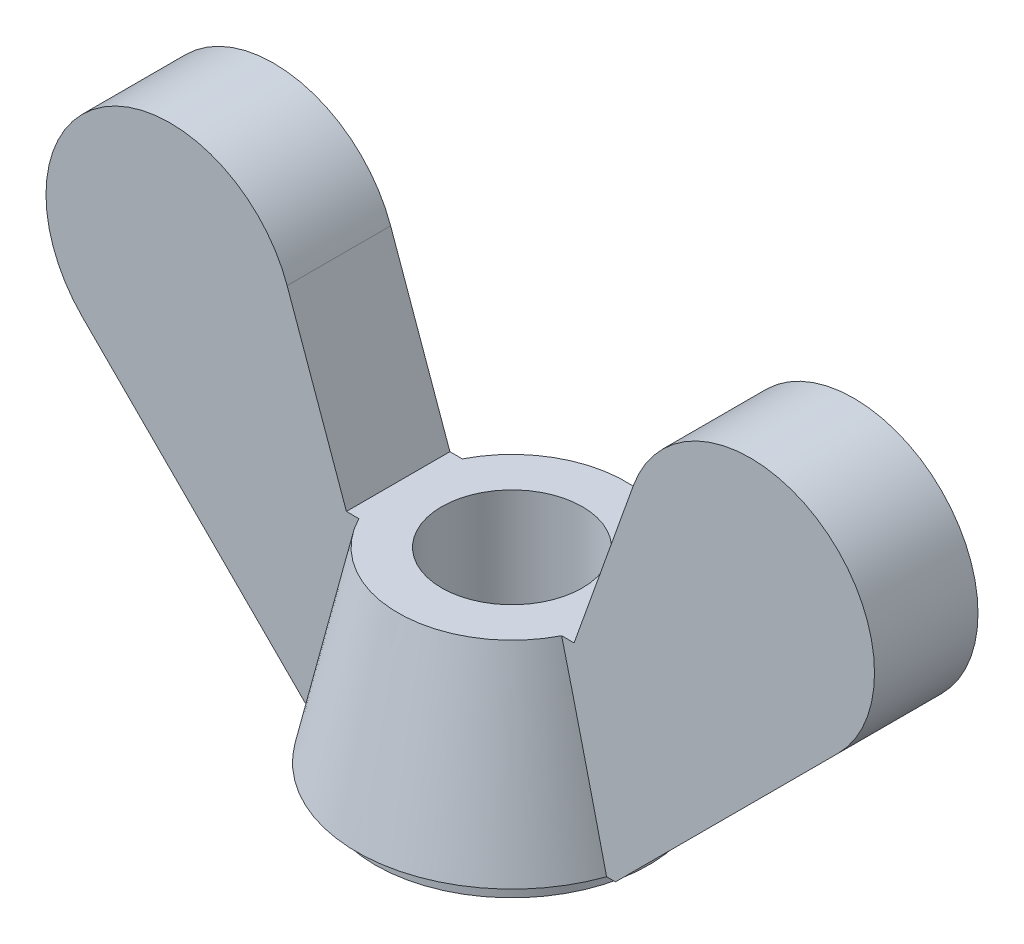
ISO-10303-21;
HEADER;
FILE_DESCRIPTION(('STEP AP214'),'2;1');
FILE_NAME('part.step','',(''),(''),'','','');
FILE_SCHEMA(('AUTOMOTIVE_DESIGN { 1 0 10303 214 1 1 1 1 }'));
ENDSEC;
DATA;
#1=APPLICATION_CONTEXT('core data for automotive mechanical design processes');
#2=APPLICATION_PROTOCOL_DEFINITION('international standard','automotive_design',2000,#1);
#3=PRODUCT_CONTEXT('',#1,'mechanical');
#4=PRODUCT('Part','Part','',(#3));
#5=PRODUCT_RELATED_PRODUCT_CATEGORY('part','',(#4));
#6=PRODUCT_DEFINITION_FORMATION('','',#4);
#7=PRODUCT_DEFINITION_CONTEXT('part definition',#1,'design');
#8=PRODUCT_DEFINITION('design','',#6,#7);
#9=PRODUCT_DEFINITION_SHAPE('','',#8);
#10=(LENGTH_UNIT() NAMED_UNIT(*) SI_UNIT(.MILLI.,.METRE.));
#11=(NAMED_UNIT(*) PLANE_ANGLE_UNIT() SI_UNIT($,.RADIAN.));
#12=(NAMED_UNIT(*) SI_UNIT($,.STERADIAN.) SOLID_ANGLE_UNIT());
#13=UNCERTAINTY_MEASURE_WITH_UNIT(LENGTH_MEASURE(1.E-05),#10,'distance_accuracy_value','');
#14=(GEOMETRIC_REPRESENTATION_CONTEXT(3) GLOBAL_UNCERTAINTY_ASSIGNED_CONTEXT((#13)) GLOBAL_UNIT_ASSIGNED_CONTEXT((#10,
#11,#12)) REPRESENTATION_CONTEXT('',''));
#15=CARTESIAN_POINT('',(0.,0.,0.));
#16=DIRECTION('',(0.,0.,1.));
#17=DIRECTION('',(1.,0.,0.));
#18=AXIS2_PLACEMENT_3D('',#15,#16,#17);
#19=CARTESIAN_POINT('',(-6.6,0.,-2.5));
#20=DIRECTION('',(0.,0.,-1.));
#21=DIRECTION('',(-1.,0.,0.));
#22=AXIS2_PLACEMENT_3D('',#19,#20,#21);
#23=PLANE('',#22);
#24=DIRECTION('',(-1.,0.,0.));
#25=VECTOR('',#24,1.);
#26=CARTESIAN_POINT('',(-6.6,10.,-2.5));
#27=LINE('',#26,#25);
#28=CARTESIAN_POINT('',(-12.1000000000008,9.99999999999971,-2.49999999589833));
#29=VERTEX_POINT('',#28);
#30=CARTESIAN_POINT('',(-11.4989794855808,10.,-2.5));
#31=VERTEX_POINT('',#30);
#32=EDGE_CURVE('E171',#29,#31,#27,.F.);
#33=ORIENTED_EDGE('',*,*,#32,.T.);
#34=CARTESIAN_POINT('',(-13.6710676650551,1.00000062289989,-2.5));
#35=CARTESIAN_POINT('',(-13.49403913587,1.75095649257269,-2.5));
#36=CARTESIAN_POINT('',(-13.3163587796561,2.5017597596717,-2.5));
#37=CARTESIAN_POINT('',(-12.959221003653,4.00293541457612,-2.5));
#38=CARTESIAN_POINT('',(-12.7797636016,4.75330780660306,-2.5));
#39=CARTESIAN_POINT('',(-12.418594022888,6.25351429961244,-2.5));
#40=CARTESIAN_POINT('',(-12.2368818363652,7.00334839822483,-2.5));
#41=CARTESIAN_POINT('',(-11.9620598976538,8.12755262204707,-2.5));
#42=CARTESIAN_POINT('',(-11.8700765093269,8.50219808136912,-2.5));
#43=CARTESIAN_POINT('',(-11.6852249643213,9.25127122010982,-2.5));
#44=CARTESIAN_POINT('',(-11.5923568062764,9.62569889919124,-2.5));
#45=CARTESIAN_POINT('',(-11.4989794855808,10.,-2.5));
#46=B_SPLINE_CURVE_WITH_KNOTS('',3,(#34,#35,#36,#37,#38,#39,#40,#41,#42,#43,#44,#45),
.UNSPECIFIED.,.F.,.F.,(4,2,2,2,2,4),(0.,2.31462088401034,4.62921868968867,6.94382662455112,
8.1011421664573,9.25845949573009),.UNSPECIFIED.);
#47=CARTESIAN_POINT('',(-13.6710676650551,1.00000062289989,-2.5));
#48=VERTEX_POINT('',#47);
#49=EDGE_CURVE('E215',#48,#31,#46,.T.);
#50=ORIENTED_EDGE('',*,*,#49,.F.);
#51=DIRECTION('',(-1.,0.,0.));
#52=VECTOR('',#51,1.);
#53=CARTESIAN_POINT('',(-6.6,1.00000009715,-2.5));
#54=LINE('',#53,#52);
#55=CARTESIAN_POINT('',(-14.1000000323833,1.00000003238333,-2.500000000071));
#56=VERTEX_POINT('',#55);
#57=EDGE_CURVE('E378',#48,#56,#54,.T.);
#58=ORIENTED_EDGE('',*,*,#57,.T.);
#59=DIRECTION('',(0.707106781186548,-0.707106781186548,0.));
#60=VECTOR('',#59,1.);
#61=CARTESIAN_POINT('',(-14.1,1.,-2.5));
#62=LINE('',#61,#60);
#63=CARTESIAN_POINT('',(-24.85735931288,11.75735931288,-2.5));
#64=VERTEX_POINT('',#63);
#65=EDGE_CURVE('E214',#64,#56,#62,.T.);
#66=ORIENTED_EDGE('',*,*,#65,.F.);
#67=CARTESIAN_POINT('',(-20.61471862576,16.,-2.5));
#68=DIRECTION('',(0.,0.,-1.));
#69=DIRECTION('',(-1.,0.,0.));
#70=AXIS2_PLACEMENT_3D('',#67,#68,#69);
#71=CIRCLE('',#70,6.);
#72=CARTESIAN_POINT('',(-14.9644209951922,18.0184490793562,-2.5));
#73=VERTEX_POINT('',#72);
#74=EDGE_CURVE('E338',#73,#64,#71,.F.);
#75=ORIENTED_EDGE('',*,*,#74,.F.);
#76=DIRECTION('',(-0.336408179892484,0.941716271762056,0.));
#77=VECTOR('',#76,1.);
#78=CARTESIAN_POINT('',(-14.96442099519,18.01844907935,-2.5));
#79=LINE('',#78,#77);
#80=EDGE_CURVE('E340',#29,#73,#79,.T.);
#81=ORIENTED_EDGE('',*,*,#80,.F.);
#82=EDGE_LOOP('',(#33,#50,#58,#66,#75,#81));
#83=FACE_BOUND('',#82,.T.);
#84=ADVANCED_FACE('F42',(#83),#23,.T.);
#85=CARTESIAN_POINT('',(-20.61471862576,16.,2.5));
#86=DIRECTION('',(0.,0.,-1.));
#87=DIRECTION('',(-1.,0.,0.));
#88=AXIS2_PLACEMENT_3D('',#85,#86,#87);
#89=CYLINDRICAL_SURFACE('',#88,6.);
#90=DIRECTION('',(0.,0.,1.));
#91=VECTOR('',#90,1.);
#92=CARTESIAN_POINT('',(-24.85735931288,11.75735931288,2.5));
#93=LINE('',#92,#91);
#94=CARTESIAN_POINT('',(-24.85735931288,11.75735931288,2.5));
#95=VERTEX_POINT('',#94);
#96=EDGE_CURVE('E370',#95,#64,#93,.F.);
#97=ORIENTED_EDGE('',*,*,#96,.F.);
#98=CARTESIAN_POINT('',(-20.61471862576,16.,2.5));
#99=DIRECTION('',(0.,0.,-1.));
#100=DIRECTION('',(-1.,0.,0.));
#101=AXIS2_PLACEMENT_3D('',#98,#99,#100);
#102=CIRCLE('',#101,6.);
#103=CARTESIAN_POINT('',(-14.9644209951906,18.0184490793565,2.5));
#104=VERTEX_POINT('',#103);
#105=EDGE_CURVE('E245',#95,#104,#102,.T.);
#106=ORIENTED_EDGE('',*,*,#105,.T.);
#107=DIRECTION('',(0.,0.,1.));
#108=VECTOR('',#107,1.);
#109=CARTESIAN_POINT('',(-14.9644209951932,18.0184490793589,2.5));
#110=LINE('',#109,#108);
#111=EDGE_CURVE('E242',#73,#104,#110,.T.);
#112=ORIENTED_EDGE('',*,*,#111,.F.);
#113=ORIENTED_EDGE('',*,*,#74,.T.);
#114=EDGE_LOOP('',(#97,#106,#112,#113));
#115=FACE_BOUND('',#114,.T.);
#116=ADVANCED_FACE('F230',(#115),#89,.T.);
#117=CARTESIAN_POINT('',(-14.96442099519,18.01844907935,2.5));
#118=DIRECTION('',(0.941716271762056,0.336408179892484,0.));
#119=DIRECTION('',(-0.336408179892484,0.941716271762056,0.));
#120=AXIS2_PLACEMENT_3D('',#117,#118,#119);
#121=PLANE('',#120);
#122=DIRECTION('',(0.336408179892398,-0.941716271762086,0.));
#123=VECTOR('',#122,1.);
#124=CARTESIAN_POINT('',(-14.96442099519,18.01844907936,2.5));
#125=LINE('',#124,#123);
#126=CARTESIAN_POINT('',(-12.1,10.,2.5));
#127=VERTEX_POINT('',#126);
#128=EDGE_CURVE('E140',#104,#127,#125,.T.);
#129=ORIENTED_EDGE('',*,*,#128,.T.);
#130=DIRECTION('',(0.,0.,1.));
#131=VECTOR('',#130,1.);
#132=CARTESIAN_POINT('',(-12.1,10.,0.));
#133=LINE('',#132,#131);
#134=EDGE_CURVE('E135',#29,#127,#133,.T.);
#135=ORIENTED_EDGE('',*,*,#134,.F.);
#136=ORIENTED_EDGE('',*,*,#80,.T.);
#137=ORIENTED_EDGE('',*,*,#111,.T.);
#138=EDGE_LOOP('',(#129,#135,#136,#137));
#139=FACE_BOUND('',#138,.T.);
#140=ADVANCED_FACE('F224',(#139),#121,.T.);
#141=CARTESIAN_POINT('',(-6.6,1.,0.));
#142=DIRECTION('',(0.,-1.,0.));
#143=DIRECTION('',(0.,0.,1.));
#144=AXIS2_PLACEMENT_3D('',#141,#142,#143);
#145=CONICAL_SURFACE('',#144,7.50000000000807,0.218668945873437);
#146=CARTESIAN_POINT('',(-6.6,10.,0.));
#147=DIRECTION('',(0.,1.,0.));
#148=DIRECTION('',(0.,0.,1.));
#149=AXIS2_PLACEMENT_3D('',#146,#147,#148);
#150=CIRCLE('',#149,5.50000000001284);
#151=CARTESIAN_POINT('',(-1.70102051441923,10.,-2.5));
#152=VERTEX_POINT('',#151);
#153=EDGE_CURVE('E341',#152,#31,#150,.T.);
#154=ORIENTED_EDGE('',*,*,#153,.F.);
#155=CARTESIAN_POINT('',(-1.70102051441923,10.,-2.5));
#156=CARTESIAN_POINT('',(-1.60764320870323,9.6256989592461,-2.5));
#157=CARTESIAN_POINT('',(-1.51477506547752,9.25127134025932,-2.5));
#158=CARTESIAN_POINT('',(-1.32992354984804,8.50219832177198,-2.5));
#159=CARTESIAN_POINT('',(-1.23794017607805,8.12755292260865,-2.5));
#160=CARTESIAN_POINT('',(-0.963118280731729,7.00334887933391,-2.5));
#161=CARTESIAN_POINT('',(-0.781406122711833,6.25351490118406,-2.5));
#162=CARTESIAN_POINT('',(-0.420236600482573,4.75330864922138,-2.5));
#163=CARTESIAN_POINT('',(-0.240779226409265,4.00293637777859,-2.5));
#164=CARTESIAN_POINT('',(0.116358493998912,2.50176096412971,-2.5));
#165=CARTESIAN_POINT('',(0.294038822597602,1.7509578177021,-2.5));
#166=CARTESIAN_POINT('',(0.471067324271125,1.00000206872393,-2.5));
#167=B_SPLINE_CURVE_WITH_KNOTS('',3,(#155,#156,#157,#158,#159,#160,#161,#162,#163,#164,#165,
#166),.UNSPECIFIED.,.F.,.F.,(4,2,2,2,2,4),(0.,1.15731714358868,2.31463249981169,
4.62924006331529,6.94383749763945,9.25845801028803),.UNSPECIFIED.);
#168=CARTESIAN_POINT('',(0.471067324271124,1.00000206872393,-2.5));
#169=VERTEX_POINT('',#168);
#170=EDGE_CURVE('E208',#152,#169,#167,.T.);
#171=ORIENTED_EDGE('',*,*,#170,.T.);
#172=CARTESIAN_POINT('',(-6.6,1.,0.));
#173=DIRECTION('',(0.,1.,0.));
#174=DIRECTION('',(0.,0.,1.));
#175=AXIS2_PLACEMENT_3D('',#172,#173,#174);
#176=CIRCLE('',#175,7.50000000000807);
#177=EDGE_CURVE('E322',#169,#48,#176,.T.);
#178=ORIENTED_EDGE('',*,*,#177,.T.);
#179=ORIENTED_EDGE('',*,*,#49,.T.);
#180=EDGE_LOOP('',(#154,#171,#178,#179));
#181=FACE_BOUND('',#180,.T.);
#182=ADVANCED_FACE('F221',(#181),#145,.T.);
#183=CARTESIAN_POINT('',(-14.1,1.,2.5));
#184=DIRECTION('',(-0.707106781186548,-0.707106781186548,0.));
#185=DIRECTION('',(0.707106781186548,-0.707106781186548,0.));
#186=AXIS2_PLACEMENT_3D('',#183,#184,#185);
#187=PLANE('',#186);
#188=ORIENTED_EDGE('',*,*,#65,.T.);
#189=DIRECTION('',(0.,0.,1.));
#190=VECTOR('',#189,1.);
#191=CARTESIAN_POINT('',(-14.1,1.,0.));
#192=LINE('',#191,#190);
#193=CARTESIAN_POINT('',(-14.1000000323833,1.00000003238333,2.5));
#194=VERTEX_POINT('',#193);
#195=EDGE_CURVE('E318',#56,#194,#192,.T.);
#196=ORIENTED_EDGE('',*,*,#195,.T.);
#197=DIRECTION('',(-0.707106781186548,0.707106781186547,0.));
#198=VECTOR('',#197,1.);
#199=CARTESIAN_POINT('',(-14.1,1.,2.5));
#200=LINE('',#199,#198);
#201=EDGE_CURVE('E249',#194,#95,#200,.T.);
#202=ORIENTED_EDGE('',*,*,#201,.T.);
#203=ORIENTED_EDGE('',*,*,#96,.T.);
#204=EDGE_LOOP('',(#188,#196,#202,#203));
#205=FACE_BOUND('',#204,.T.);
#206=ADVANCED_FACE('F205',(#205),#187,.T.);
#207=CARTESIAN_POINT('',(-6.6,0.,-2.5));
#208=DIRECTION('',(0.,0.,1.));
#209=DIRECTION('',(1.,0.,0.));
#210=AXIS2_PLACEMENT_3D('',#207,#208,#209);
#211=PLANE('',#210);
#212=DIRECTION('',(0.336408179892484,0.941716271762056,0.));
#213=VECTOR('',#212,1.);
#214=CARTESIAN_POINT('',(1.764420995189,18.01844907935,-2.5));
#215=LINE('',#214,#213);
#216=CARTESIAN_POINT('',(-1.09999999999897,9.99999999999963,-2.5));
#217=VERTEX_POINT('',#216);
#218=CARTESIAN_POINT('',(1.76442099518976,18.0184490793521,-2.5));
#219=VERTEX_POINT('',#218);
#220=EDGE_CURVE('E159',#217,#219,#215,.T.);
#221=ORIENTED_EDGE('',*,*,#220,.T.);
#222=CARTESIAN_POINT('',(7.414718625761,16.,-2.5));
#223=DIRECTION('',(0.,0.,1.));
#224=DIRECTION('',(1.,0.,0.));
#225=AXIS2_PLACEMENT_3D('',#222,#223,#224);
#226=CIRCLE('',#225,6.);
#227=CARTESIAN_POINT('',(11.6573593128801,11.7573593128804,-2.5));
#228=VERTEX_POINT('',#227);
#229=EDGE_CURVE('E297',#228,#219,#226,.T.);
#230=ORIENTED_EDGE('',*,*,#229,.F.);
#231=DIRECTION('',(-0.707106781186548,-0.707106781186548,0.));
#232=VECTOR('',#231,1.);
#233=CARTESIAN_POINT('',(0.9,1.,-2.5));
#234=LINE('',#233,#232);
#235=CARTESIAN_POINT('',(0.9,1.,-2.5));
#236=VERTEX_POINT('',#235);
#237=EDGE_CURVE('E272',#228,#236,#234,.T.);
#238=ORIENTED_EDGE('',*,*,#237,.T.);
#239=DIRECTION('',(1.,0.,0.));
#240=VECTOR('',#239,1.);
#241=CARTESIAN_POINT('',(-6.6,1.,-2.5));
#242=LINE('',#241,#240);
#243=EDGE_CURVE('E139',#236,#169,#242,.F.);
#244=ORIENTED_EDGE('',*,*,#243,.T.);
#245=ORIENTED_EDGE('',*,*,#170,.F.);
#246=DIRECTION('',(1.,0.,0.));
#247=VECTOR('',#246,1.);
#248=CARTESIAN_POINT('',(-6.6,10.,-2.5));
#249=LINE('',#248,#247);
#250=EDGE_CURVE('E344',#217,#152,#249,.F.);
#251=ORIENTED_EDGE('',*,*,#250,.F.);
#252=EDGE_LOOP('',(#221,#230,#238,#244,#245,#251));
#253=FACE_BOUND('',#252,.T.);
#254=ADVANCED_FACE('F200',(#253),#211,.F.);
#255=CARTESIAN_POINT('',(-6.6,10.,0.));
#256=DIRECTION('',(0.,1.,0.));
#257=DIRECTION('',(0.,0.,1.));
#258=AXIS2_PLACEMENT_3D('',#255,#256,#257);
#259=PLANE('',#258);
#260=CARTESIAN_POINT('',(-6.6,10.,0.));
#261=DIRECTION('',(0.,1.,0.));
#262=DIRECTION('',(0.,0.,1.));
#263=AXIS2_PLACEMENT_3D('',#260,#261,#262);
#264=CIRCLE('',#263,3.39999999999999);
#265=CARTESIAN_POINT('',(-6.6,10.,3.39999999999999));
#266=VERTEX_POINT('',#265);
#267=EDGE_CURVE('E404',#266,#266,#264,.T.);
#268=ORIENTED_EDGE('',*,*,#267,.F.);
#269=EDGE_LOOP('',(#268));
#270=FACE_BOUND('',#269,.T.);
#271=ORIENTED_EDGE('',*,*,#250,.T.);
#272=ORIENTED_EDGE('',*,*,#153,.T.);
#273=ORIENTED_EDGE('',*,*,#32,.F.);
#274=ORIENTED_EDGE('',*,*,#134,.T.);
#275=DIRECTION('',(-1.,0.,0.));
#276=VECTOR('',#275,1.);
#277=CARTESIAN_POINT('',(-6.6,10.,2.5));
#278=LINE('',#277,#276);
#279=CARTESIAN_POINT('',(-11.4989794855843,10.,2.5));
#280=VERTEX_POINT('',#279);
#281=EDGE_CURVE('E127',#127,#280,#278,.F.);
#282=ORIENTED_EDGE('',*,*,#281,.T.);
#283=CARTESIAN_POINT('',(-6.6,10.,0.));
#284=DIRECTION('',(0.,1.,0.));
#285=DIRECTION('',(0.,0.,1.));
#286=AXIS2_PLACEMENT_3D('',#283,#284,#285);
#287=CIRCLE('',#286,5.500000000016);
#288=CARTESIAN_POINT('',(-1.70102050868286,10.,2.499999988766));
#289=VERTEX_POINT('',#288);
#290=EDGE_CURVE('E132',#289,#280,#287,.F.);
#291=ORIENTED_EDGE('',*,*,#290,.F.);
#292=DIRECTION('',(1.,0.,0.));
#293=VECTOR('',#292,1.);
#294=CARTESIAN_POINT('',(-6.6,10.,2.499999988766));
#295=LINE('',#294,#293);
#296=CARTESIAN_POINT('',(-1.09999999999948,9.99999999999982,2.49999999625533));
#297=VERTEX_POINT('',#296);
#298=EDGE_CURVE('E60',#289,#297,#295,.T.);
#299=ORIENTED_EDGE('',*,*,#298,.T.);
#300=DIRECTION('',(0.,0.,1.));
#301=VECTOR('',#300,1.);
#302=CARTESIAN_POINT('',(-1.09999999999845,9.99999999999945,2.5));
#303=LINE('',#302,#301);
#304=EDGE_CURVE('E293',#297,#217,#303,.F.);
#305=ORIENTED_EDGE('',*,*,#304,.T.);
#306=EDGE_LOOP('',(#271,#272,#273,#274,#282,#291,#299,#305));
#307=FACE_BOUND('',#306,.T.);
#308=ADVANCED_FACE('F130',(#270,#307),#259,.T.);
#309=CARTESIAN_POINT('',(-6.6,0.,2.5));
#310=DIRECTION('',(0.,0.,-1.));
#311=DIRECTION('',(-1.,0.,0.));
#312=AXIS2_PLACEMENT_3D('',#309,#310,#311);
#313=PLANE('',#312);
#314=ORIENTED_EDGE('',*,*,#128,.F.);
#315=ORIENTED_EDGE('',*,*,#105,.F.);
#316=ORIENTED_EDGE('',*,*,#201,.F.);
#317=DIRECTION('',(1.,0.,0.));
#318=VECTOR('',#317,1.);
#319=CARTESIAN_POINT('',(-6.6,1.,2.5));
#320=LINE('',#319,#318);
#321=CARTESIAN_POINT('',(-13.671067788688,1.00000009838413,2.5));
#322=VERTEX_POINT('',#321);
#323=EDGE_CURVE('E147',#194,#322,#320,.T.);
#324=ORIENTED_EDGE('',*,*,#323,.T.);
#325=CARTESIAN_POINT('',(-13.671067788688,1.00000009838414,2.5));
#326=CARTESIAN_POINT('',(-13.553234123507,1.49991784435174,2.5));
#327=CARTESIAN_POINT('',(-13.4350950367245,1.99976346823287,2.5));
#328=CARTESIAN_POINT('',(-13.1980921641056,2.99928307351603,2.5));
#329=CARTESIAN_POINT('',(-13.0792283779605,3.49895705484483,2.5));
#330=CARTESIAN_POINT('',(-12.7213860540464,4.99765166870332,2.5));
#331=CARTESIAN_POINT('',(-12.4811499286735,5.99637312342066,2.5));
#332=CARTESIAN_POINT('',(-12.1171915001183,7.49358932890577,2.5));
#333=CARTESIAN_POINT('',(-11.9952701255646,7.99252186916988,2.5));
#334=CARTESIAN_POINT('',(-11.7499485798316,8.99002236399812,2.5));
#335=CARTESIAN_POINT('',(-11.6265484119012,9.48859031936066,2.5));
#336=CARTESIAN_POINT('',(-11.377927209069,10.485287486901,2.5));
#337=CARTESIAN_POINT('',(-11.2527061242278,10.9834166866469,2.5));
#338=CARTESIAN_POINT('',(-10.9999214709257,11.9790839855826,2.5));
#339=CARTESIAN_POINT('',(-10.8723578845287,12.4766220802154,2.5));
#340=CARTESIAN_POINT('',(-10.7433615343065,12.9737914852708,2.5));
#341=B_SPLINE_CURVE_WITH_KNOTS('',3,(#325,#326,#327,#328,#329,#330,#331,#332,#333,#334,#335,
#336,#337,#338,#339,#340),.UNSPECIFIED.,.F.,.F.,(4,2,2,2,2,2,2,4),(0.,1.54085085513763,
3.08170236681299,6.16331862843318,7.70415644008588,9.24499086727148,10.7858676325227,
12.3267562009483),.UNSPECIFIED.);
#342=EDGE_CURVE('E143',#280,#322,#341,.F.);
#343=ORIENTED_EDGE('',*,*,#342,.F.);
#344=ORIENTED_EDGE('',*,*,#281,.F.);
#345=EDGE_LOOP('',(#314,#315,#316,#324,#343,#344));
#346=FACE_BOUND('',#345,.T.);
#347=ADVANCED_FACE('F144',(#346),#313,.F.);
#348=CARTESIAN_POINT('',(-6.6,1.,0.));
#349=DIRECTION('',(0.,1.,0.));
#350=DIRECTION('',(0.,0.,1.));
#351=AXIS2_PLACEMENT_3D('',#348,#349,#350);
#352=PLANE('',#351);
#353=CARTESIAN_POINT('',(-6.6,1.,0.));
#354=DIRECTION('',(0.,1.,0.));
#355=DIRECTION('',(0.,0.,1.));
#356=AXIS2_PLACEMENT_3D('',#353,#354,#355);
#357=CIRCLE('',#356,6.6);
#358=CARTESIAN_POINT('',(-6.6,1.,6.6));
#359=VERTEX_POINT('',#358);
#360=EDGE_CURVE('E401',#359,#359,#357,.T.);
#361=ORIENTED_EDGE('',*,*,#360,.T.);
#362=EDGE_LOOP('',(#361));
#363=FACE_BOUND('',#362,.T.);
#364=CARTESIAN_POINT('',(-6.6,1.00000019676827,0.));
#365=DIRECTION('',(0.,-1.,0.));
#366=DIRECTION('',(0.,0.,-1.));
#367=AXIS2_PLACEMENT_3D('',#364,#365,#366);
#368=CIRCLE('',#367,7.49999995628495);
#369=CARTESIAN_POINT('',(0.471067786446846,1.00000009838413,2.500000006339));
#370=VERTEX_POINT('',#369);
#371=EDGE_CURVE('E152',#322,#370,#368,.F.);
#372=ORIENTED_EDGE('',*,*,#371,.F.);
#373=ORIENTED_EDGE('',*,*,#323,.F.);
#374=ORIENTED_EDGE('',*,*,#195,.F.);
#375=ORIENTED_EDGE('',*,*,#57,.F.);
#376=ORIENTED_EDGE('',*,*,#177,.F.);
#377=ORIENTED_EDGE('',*,*,#243,.F.);
#378=DIRECTION('',(0.,0.,1.));
#379=VECTOR('',#378,1.);
#380=CARTESIAN_POINT('',(0.9,1.,2.5));
#381=LINE('',#380,#379);
#382=CARTESIAN_POINT('',(0.900000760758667,1.00000076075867,2.500000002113));
#383=VERTEX_POINT('',#382);
#384=EDGE_CURVE('E304',#236,#383,#381,.T.);
#385=ORIENTED_EDGE('',*,*,#384,.T.);
#386=DIRECTION('',(1.,0.,0.));
#387=VECTOR('',#386,1.);
#388=CARTESIAN_POINT('',(-6.6,1.,2.500000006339));
#389=LINE('',#388,#387);
#390=EDGE_CURVE('E308',#370,#383,#389,.T.);
#391=ORIENTED_EDGE('',*,*,#390,.F.);
#392=EDGE_LOOP('',(#372,#373,#374,#375,#376,#377,#385,#391));
#393=FACE_BOUND('',#392,.T.);
#394=ADVANCED_FACE('F191',(#363,#393),#352,.F.);
#395=CARTESIAN_POINT('',(0.9,1.,2.5));
#396=DIRECTION('',(-0.707106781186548,0.707106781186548,0.));
#397=DIRECTION('',(-0.707106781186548,-0.707106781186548,0.));
#398=AXIS2_PLACEMENT_3D('',#395,#396,#397);
#399=PLANE('',#398);
#400=DIRECTION('',(0.,0.,1.));
#401=VECTOR('',#400,1.);
#402=CARTESIAN_POINT('',(11.6573593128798,11.7573593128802,2.5));
#403=LINE('',#402,#401);
#404=CARTESIAN_POINT('',(11.6573593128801,11.7573593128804,2.5));
#405=VERTEX_POINT('',#404);
#406=EDGE_CURVE('E300',#405,#228,#403,.F.);
#407=ORIENTED_EDGE('',*,*,#406,.F.);
#408=DIRECTION('',(0.707106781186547,0.707106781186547,0.));
#409=VECTOR('',#408,1.);
#410=CARTESIAN_POINT('',(0.9,1.,2.5));
#411=LINE('',#410,#409);
#412=EDGE_CURVE('E387',#383,#405,#411,.T.);
#413=ORIENTED_EDGE('',*,*,#412,.F.);
#414=ORIENTED_EDGE('',*,*,#384,.F.);
#415=ORIENTED_EDGE('',*,*,#237,.F.);
#416=EDGE_LOOP('',(#407,#413,#414,#415));
#417=FACE_BOUND('',#416,.T.);
#418=ADVANCED_FACE('F187',(#417),#399,.F.);
#419=CARTESIAN_POINT('',(7.414718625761,16.,2.5));
#420=DIRECTION('',(0.,0.,1.));
#421=DIRECTION('',(1.,0.,0.));
#422=AXIS2_PLACEMENT_3D('',#419,#420,#421);
#423=CYLINDRICAL_SURFACE('',#422,6.);
#424=DIRECTION('',(0.,0.,1.));
#425=VECTOR('',#424,1.);
#426=CARTESIAN_POINT('',(1.764420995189,18.01844907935,2.5));
#427=LINE('',#426,#425);
#428=CARTESIAN_POINT('',(1.76442099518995,18.0184490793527,2.5));
#429=VERTEX_POINT('',#428);
#430=EDGE_CURVE('E155',#219,#429,#427,.T.);
#431=ORIENTED_EDGE('',*,*,#430,.T.);
#432=CARTESIAN_POINT('',(7.414718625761,16.,2.5));
#433=DIRECTION('',(0.,0.,1.));
#434=DIRECTION('',(1.,0.,0.));
#435=AXIS2_PLACEMENT_3D('',#432,#433,#434);
#436=CIRCLE('',#435,6.);
#437=EDGE_CURVE('E384',#405,#429,#436,.T.);
#438=ORIENTED_EDGE('',*,*,#437,.F.);
#439=ORIENTED_EDGE('',*,*,#406,.T.);
#440=ORIENTED_EDGE('',*,*,#229,.T.);
#441=EDGE_LOOP('',(#431,#438,#439,#440));
#442=FACE_BOUND('',#441,.T.);
#443=ADVANCED_FACE('F183',(#442),#423,.T.);
#444=CARTESIAN_POINT('',(1.764420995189,18.01844907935,2.5));
#445=DIRECTION('',(0.941716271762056,-0.336408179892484,0.));
#446=DIRECTION('',(0.336408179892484,0.941716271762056,0.));
#447=AXIS2_PLACEMENT_3D('',#444,#445,#446);
#448=PLANE('',#447);
#449=ORIENTED_EDGE('',*,*,#430,.F.);
#450=ORIENTED_EDGE('',*,*,#220,.F.);
#451=ORIENTED_EDGE('',*,*,#304,.F.);
#452=DIRECTION('',(-0.336408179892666,-0.941716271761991,0.));
#453=VECTOR('',#452,1.);
#454=CARTESIAN_POINT('',(1.764420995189,18.01844907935,2.5));
#455=LINE('',#454,#453);
#456=EDGE_CURVE('E53',#429,#297,#455,.T.);
#457=ORIENTED_EDGE('',*,*,#456,.F.);
#458=EDGE_LOOP('',(#449,#450,#451,#457));
#459=FACE_BOUND('',#458,.T.);
#460=ADVANCED_FACE('F180',(#459),#448,.F.);
#461=CARTESIAN_POINT('',(-6.6,1.00000019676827,0.));
#462=DIRECTION('',(0.,-1.,0.));
#463=DIRECTION('',(0.,0.,-1.));
#464=AXIS2_PLACEMENT_3D('',#461,#462,#463);
#465=CONICAL_SURFACE('',#464,7.49999995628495,0.218668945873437);
#466=ORIENTED_EDGE('',*,*,#371,.T.);
#467=CARTESIAN_POINT('',(-1.70102050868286,10.,2.499999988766));
#468=CARTESIAN_POINT('',(-1.60764318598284,9.62569887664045,2.49999999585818));
#469=CARTESIAN_POINT('',(-1.51477502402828,9.25127117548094,2.49999999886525));
#470=CARTESIAN_POINT('',(-1.32992346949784,8.5021979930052,2.50000000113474));
#471=CARTESIAN_POINT('',(-1.23794007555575,8.12755251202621,2.50000000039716));
#472=CARTESIAN_POINT('',(-0.963118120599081,7.00334822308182,2.49999999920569));
#473=CARTESIAN_POINT('',(-0.781405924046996,6.25351408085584,2.49999999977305));
#474=CARTESIAN_POINT('',(-0.420236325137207,4.75330750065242,2.50000000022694));
#475=CARTESIAN_POINT('',(-0.240778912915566,4.00293506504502,2.50000000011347));
#476=CARTESIAN_POINT('',(0.116358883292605,2.50175932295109,2.49999999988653));
#477=CARTESIAN_POINT('',(0.294039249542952,1.75095601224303,2.49999999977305));
#478=CARTESIAN_POINT('',(0.47106778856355,1.00000009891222,2.5));
#479=B_SPLINE_CURVE_WITH_KNOTS('',3,(#467,#468,#469,#470,#471,#472,#473,#474,#475,#476,#477,
#478),.UNSPECIFIED.,.F.,.F.,(4,2,2,2,2,4),(0.,1.1573173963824,2.31463300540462,4.62924107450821,
6.94383901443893,9.25846003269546),.UNSPECIFIED.);
#480=EDGE_CURVE('E12',#289,#370,#479,.T.);
#481=ORIENTED_EDGE('',*,*,#480,.F.);
#482=ORIENTED_EDGE('',*,*,#290,.T.);
#483=ORIENTED_EDGE('',*,*,#342,.T.);
#484=EDGE_LOOP('',(#466,#481,#482,#483));
#485=FACE_BOUND('',#484,.T.);
#486=ADVANCED_FACE('F44',(#485),#465,.T.);
#487=CARTESIAN_POINT('',(-6.6,0.,2.5));
#488=DIRECTION('',(0.,0.,1.));
#489=DIRECTION('',(1.,0.,0.));
#490=AXIS2_PLACEMENT_3D('',#487,#488,#489);
#491=PLANE('',#490);
#492=ORIENTED_EDGE('',*,*,#298,.F.);
#493=ORIENTED_EDGE('',*,*,#480,.T.);
#494=ORIENTED_EDGE('',*,*,#390,.T.);
#495=ORIENTED_EDGE('',*,*,#412,.T.);
#496=ORIENTED_EDGE('',*,*,#437,.T.);
#497=ORIENTED_EDGE('',*,*,#456,.T.);
#498=EDGE_LOOP('',(#492,#493,#494,#495,#496,#497));
#499=FACE_BOUND('',#498,.T.);
#500=ADVANCED_FACE('F173',(#499),#491,.T.);
#501=CARTESIAN_POINT('',(-6.6,0.,0.));
#502=DIRECTION('',(0.,1.,0.));
#503=DIRECTION('',(0.,0.,1.));
#504=AXIS2_PLACEMENT_3D('',#501,#502,#503);
#505=CYLINDRICAL_SURFACE('',#504,6.6);
#506=CARTESIAN_POINT('',(-6.6,0.,0.));
#507=DIRECTION('',(0.,1.,0.));
#508=DIRECTION('',(0.,0.,1.));
#509=AXIS2_PLACEMENT_3D('',#506,#507,#508);
#510=CIRCLE('',#509,6.6);
#511=CARTESIAN_POINT('',(-6.6,0.,6.6));
#512=VERTEX_POINT('',#511);
#513=EDGE_CURVE('E381',#512,#512,#510,.T.);
#514=ORIENTED_EDGE('',*,*,#513,.T.);
#515=EDGE_LOOP('',(#514));
#516=FACE_BOUND('',#515,.T.);
#517=ORIENTED_EDGE('',*,*,#360,.F.);
#518=EDGE_LOOP('',(#517));
#519=FACE_BOUND('',#518,.T.);
#520=ADVANCED_FACE('F178',(#516,#519),#505,.T.);
#521=CARTESIAN_POINT('',(0.,0.,0.));
#522=DIRECTION('',(0.,-1.,0.));
#523=DIRECTION('',(0.,0.,-1.));
#524=AXIS2_PLACEMENT_3D('',#521,#522,#523);
#525=PLANE('',#524);
#526=CARTESIAN_POINT('',(-6.6,0.,0.));
#527=DIRECTION('',(0.,-1.,0.));
#528=DIRECTION('',(0.,0.,-1.));
#529=AXIS2_PLACEMENT_3D('',#526,#527,#528);
#530=CIRCLE('',#529,3.39999999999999);
#531=CARTESIAN_POINT('',(-6.6,0.,-3.39999999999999));
#532=VERTEX_POINT('',#531);
#533=EDGE_CURVE('E407',#532,#532,#530,.T.);
#534=ORIENTED_EDGE('',*,*,#533,.F.);
#535=EDGE_LOOP('',(#534));
#536=FACE_BOUND('',#535,.T.);
#537=ORIENTED_EDGE('',*,*,#513,.F.);
#538=EDGE_LOOP('',(#537));
#539=FACE_BOUND('',#538,.T.);
#540=ADVANCED_FACE('F413',(#536,#539),#525,.T.);
#541=CARTESIAN_POINT('',(-6.6,0.,0.));
#542=DIRECTION('',(0.,-1.,0.));
#543=DIRECTION('',(0.,0.,-1.));
#544=AXIS2_PLACEMENT_3D('',#541,#542,#543);
#545=CYLINDRICAL_SURFACE('',#544,3.39999999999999);
#546=ORIENTED_EDGE('',*,*,#267,.T.);
#547=EDGE_LOOP('',(#546));
#548=FACE_BOUND('',#547,.T.);
#549=ORIENTED_EDGE('',*,*,#533,.T.);
#550=EDGE_LOOP('',(#549));
#551=FACE_BOUND('',#550,.T.);
#552=ADVANCED_FACE('F411',(#548,#551),#545,.F.);
#553=CLOSED_SHELL('',(#84,#116,#140,#182,#206,#254,#308,#347,#394,#418,#443,#460,#486,#500,#520,
#540,#552));
#554=MANIFOLD_SOLID_BREP('B2',#553);
#555=ADVANCED_BREP_SHAPE_REPRESENTATION('',(#18,#554),#14);
#556=SHAPE_DEFINITION_REPRESENTATION(#9,#555);
ENDSEC;
END-ISO-10303-21;
